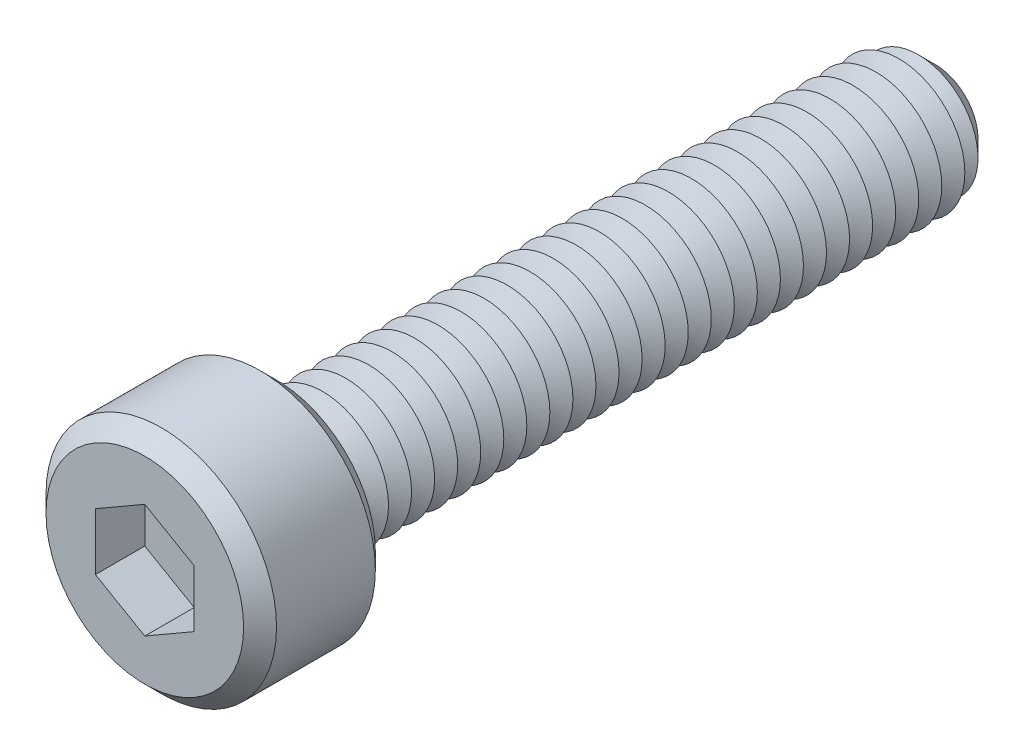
ISO-10303-21;
HEADER;
FILE_DESCRIPTION(('STEP AP214'),'2;1');
FILE_NAME('part.step','',(''),(''),'','','');
FILE_SCHEMA(('AUTOMOTIVE_DESIGN { 1 0 10303 214 1 1 1 1 }'));
ENDSEC;
DATA;
#1=APPLICATION_CONTEXT('core data for automotive mechanical design processes');
#2=APPLICATION_PROTOCOL_DEFINITION('international standard','automotive_design',2000,#1);
#3=PRODUCT_CONTEXT('',#1,'mechanical');
#4=PRODUCT('Part','Part','',(#3));
#5=PRODUCT_RELATED_PRODUCT_CATEGORY('part','',(#4));
#6=PRODUCT_DEFINITION_FORMATION('','',#4);
#7=PRODUCT_DEFINITION_CONTEXT('part definition',#1,'design');
#8=PRODUCT_DEFINITION('design','',#6,#7);
#9=PRODUCT_DEFINITION_SHAPE('','',#8);
#10=(LENGTH_UNIT() NAMED_UNIT(*) SI_UNIT(.MILLI.,.METRE.));
#11=(NAMED_UNIT(*) PLANE_ANGLE_UNIT() SI_UNIT($,.RADIAN.));
#12=(NAMED_UNIT(*) SI_UNIT($,.STERADIAN.) SOLID_ANGLE_UNIT());
#13=UNCERTAINTY_MEASURE_WITH_UNIT(LENGTH_MEASURE(1.E-05),#10,'distance_accuracy_value','');
#14=(GEOMETRIC_REPRESENTATION_CONTEXT(3) GLOBAL_UNCERTAINTY_ASSIGNED_CONTEXT((#13)) GLOBAL_UNIT_ASSIGNED_CONTEXT((#10,
#11,#12)) REPRESENTATION_CONTEXT('',''));
#15=CARTESIAN_POINT('',(0.,0.,0.));
#16=DIRECTION('',(0.,0.,1.));
#17=DIRECTION('',(1.,0.,0.));
#18=AXIS2_PLACEMENT_3D('',#15,#16,#17);
#19=CARTESIAN_POINT('',(0.,0.,4.));
#20=DIRECTION('',(0.,0.,-1.));
#21=DIRECTION('',(-1.,0.,0.));
#22=AXIS2_PLACEMENT_3D('',#19,#20,#21);
#23=CYLINDRICAL_SURFACE('',#22,3.5);
#24=CARTESIAN_POINT('',(0.,0.,0.5));
#25=DIRECTION('',(0.,0.,1.));
#26=DIRECTION('',(1.,0.,0.));
#27=AXIS2_PLACEMENT_3D('',#24,#25,#26);
#28=CIRCLE('',#27,3.5);
#29=CARTESIAN_POINT('',(3.5,0.,0.5));
#30=VERTEX_POINT('',#29);
#31=EDGE_CURVE('E400',#30,#30,#28,.T.);
#32=ORIENTED_EDGE('',*,*,#31,.T.);
#33=EDGE_LOOP('',(#32));
#34=FACE_BOUND('',#33,.T.);
#35=CARTESIAN_POINT('',(0.,0.,3.5));
#36=DIRECTION('',(0.,0.,1.));
#37=DIRECTION('',(1.,0.,0.));
#38=AXIS2_PLACEMENT_3D('',#35,#36,#37);
#39=CIRCLE('',#38,3.5);
#40=CARTESIAN_POINT('',(3.5,0.,3.5));
#41=VERTEX_POINT('',#40);
#42=EDGE_CURVE('E393',#41,#41,#39,.F.);
#43=ORIENTED_EDGE('',*,*,#42,.T.);
#44=EDGE_LOOP('',(#43));
#45=FACE_BOUND('',#44,.T.);
#46=ADVANCED_FACE('F39',(#34,#45),#23,.T.);
#47=CARTESIAN_POINT('',(0.,0.,4.));
#48=DIRECTION('',(0.,0.,1.));
#49=DIRECTION('',(1.,0.,0.));
#50=AXIS2_PLACEMENT_3D('',#47,#48,#49);
#51=PLANE('',#50);
#52=CARTESIAN_POINT('',(0.,0.,4.));
#53=DIRECTION('',(0.,0.,1.));
#54=DIRECTION('',(1.,0.,0.));
#55=AXIS2_PLACEMENT_3D('',#52,#53,#54);
#56=CIRCLE('',#55,3.);
#57=CARTESIAN_POINT('',(3.,0.,4.));
#58=VERTEX_POINT('',#57);
#59=EDGE_CURVE('E11',#58,#58,#56,.T.);
#60=ORIENTED_EDGE('',*,*,#59,.T.);
#61=EDGE_LOOP('',(#60));
#62=FACE_BOUND('',#61,.T.);
#63=DIRECTION('',(-0.866025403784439,0.5,0.));
#64=VECTOR('',#63,1.);
#65=CARTESIAN_POINT('',(1.5,0.866025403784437,4.));
#66=LINE('',#65,#64);
#67=CARTESIAN_POINT('',(1.5,0.866025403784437,4.));
#68=VERTEX_POINT('',#67);
#69=CARTESIAN_POINT('',(0.,1.73205080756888,4.));
#70=VERTEX_POINT('',#69);
#71=EDGE_CURVE('E55',#68,#70,#66,.T.);
#72=ORIENTED_EDGE('',*,*,#71,.F.);
#73=DIRECTION('',(0.,1.,0.));
#74=VECTOR('',#73,1.);
#75=CARTESIAN_POINT('',(1.5,-0.866025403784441,4.));
#76=LINE('',#75,#74);
#77=CARTESIAN_POINT('',(1.5,-0.866025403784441,4.));
#78=VERTEX_POINT('',#77);
#79=EDGE_CURVE('E151',#78,#68,#76,.T.);
#80=ORIENTED_EDGE('',*,*,#79,.F.);
#81=DIRECTION('',(0.866025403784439,0.5,0.));
#82=VECTOR('',#81,1.);
#83=CARTESIAN_POINT('',(0.,-1.73205080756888,4.));
#84=LINE('',#83,#82);
#85=CARTESIAN_POINT('',(0.,-1.73205080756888,4.));
#86=VERTEX_POINT('',#85);
#87=EDGE_CURVE('E148',#86,#78,#84,.T.);
#88=ORIENTED_EDGE('',*,*,#87,.F.);
#89=DIRECTION('',(0.866025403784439,-0.5,0.));
#90=VECTOR('',#89,1.);
#91=CARTESIAN_POINT('',(-1.5,-0.86602540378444,4.));
#92=LINE('',#91,#90);
#93=CARTESIAN_POINT('',(-1.5,-0.86602540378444,4.));
#94=VERTEX_POINT('',#93);
#95=EDGE_CURVE('E103',#94,#86,#92,.T.);
#96=ORIENTED_EDGE('',*,*,#95,.F.);
#97=DIRECTION('',(0.,-1.,0.));
#98=VECTOR('',#97,1.);
#99=CARTESIAN_POINT('',(-1.5,0.866025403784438,4.));
#100=LINE('',#99,#98);
#101=CARTESIAN_POINT('',(-1.5,0.866025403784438,4.));
#102=VERTEX_POINT('',#101);
#103=EDGE_CURVE('E142',#102,#94,#100,.T.);
#104=ORIENTED_EDGE('',*,*,#103,.F.);
#105=DIRECTION('',(-0.866025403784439,-0.5,0.));
#106=VECTOR('',#105,1.);
#107=CARTESIAN_POINT('',(0.,1.73205080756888,4.));
#108=LINE('',#107,#106);
#109=EDGE_CURVE('E137',#70,#102,#108,.T.);
#110=ORIENTED_EDGE('',*,*,#109,.F.);
#111=EDGE_LOOP('',(#72,#80,#88,#96,#104,#110));
#112=FACE_BOUND('',#111,.T.);
#113=ADVANCED_FACE('F418',(#62,#112),#51,.T.);
#114=CARTESIAN_POINT('',(0.,0.,0.));
#115=DIRECTION('',(0.,0.,1.));
#116=DIRECTION('',(1.,0.,0.));
#117=AXIS2_PLACEMENT_3D('',#114,#115,#116);
#118=PLANE('',#117);
#119=CARTESIAN_POINT('',(0.,0.,0.));
#120=DIRECTION('',(0.,0.,1.));
#121=DIRECTION('',(1.,0.,0.));
#122=AXIS2_PLACEMENT_3D('',#119,#120,#121);
#123=CIRCLE('',#122,3.);
#124=CARTESIAN_POINT('',(3.,0.,0.));
#125=VERTEX_POINT('',#124);
#126=EDGE_CURVE('E48',#125,#125,#123,.F.);
#127=ORIENTED_EDGE('',*,*,#126,.T.);
#128=EDGE_LOOP('',(#127));
#129=FACE_BOUND('',#128,.T.);
#130=CARTESIAN_POINT('',(0.,0.,0.));
#131=DIRECTION('',(0.,0.,1.));
#132=DIRECTION('',(1.,0.,0.));
#133=AXIS2_PLACEMENT_3D('',#130,#131,#132);
#134=CIRCLE('',#133,2.);
#135=CARTESIAN_POINT('',(2.,0.,0.));
#136=VERTEX_POINT('',#135);
#137=EDGE_CURVE('E385',#136,#136,#134,.T.);
#138=ORIENTED_EDGE('',*,*,#137,.T.);
#139=EDGE_LOOP('',(#138));
#140=FACE_BOUND('',#139,.T.);
#141=ADVANCED_FACE('F407',(#129,#140),#118,.F.);
#142=CARTESIAN_POINT('',(0.,0.,0.));
#143=DIRECTION('',(0.,0.,1.));
#144=DIRECTION('',(1.,0.,0.));
#145=AXIS2_PLACEMENT_3D('',#142,#143,#144);
#146=CONICAL_SURFACE('',#145,2.,1.0471975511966);
#147=CARTESIAN_POINT('',(0.,0.,-0.35));
#148=DIRECTION('',(0.,0.,1.));
#149=DIRECTION('',(1.,0.,0.));
#150=AXIS2_PLACEMENT_3D('',#147,#148,#149);
#151=CIRCLE('',#150,1.39378221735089);
#152=CARTESIAN_POINT('',(1.39378221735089,0.,-0.35));
#153=VERTEX_POINT('',#152);
#154=EDGE_CURVE('E381',#153,#153,#151,.T.);
#155=ORIENTED_EDGE('',*,*,#154,.T.);
#156=EDGE_LOOP('',(#155));
#157=FACE_BOUND('',#156,.T.);
#158=ORIENTED_EDGE('',*,*,#137,.F.);
#159=EDGE_LOOP('',(#158));
#160=FACE_BOUND('',#159,.T.);
#161=ADVANCED_FACE('F692',(#157,#160),#146,.T.);
#162=CARTESIAN_POINT('',(0.,0.,-0.35));
#163=DIRECTION('',(0.,0.,-1.));
#164=DIRECTION('',(-1.,0.,0.));
#165=AXIS2_PLACEMENT_3D('',#162,#163,#164);
#166=CONICAL_SURFACE('',#165,1.39378221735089,1.0471975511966);
#167=CARTESIAN_POINT('',(0.,0.,-0.7));
#168=DIRECTION('',(0.,0.,1.));
#169=DIRECTION('',(1.,0.,0.));
#170=AXIS2_PLACEMENT_3D('',#167,#168,#169);
#171=CIRCLE('',#170,2.);
#172=CARTESIAN_POINT('',(2.,0.,-0.7));
#173=VERTEX_POINT('',#172);
#174=EDGE_CURVE('E377',#173,#173,#171,.T.);
#175=ORIENTED_EDGE('',*,*,#174,.T.);
#176=EDGE_LOOP('',(#175));
#177=FACE_BOUND('',#176,.T.);
#178=ORIENTED_EDGE('',*,*,#154,.F.);
#179=EDGE_LOOP('',(#178));
#180=FACE_BOUND('',#179,.T.);
#181=ADVANCED_FACE('F688',(#177,#180),#166,.T.);
#182=CARTESIAN_POINT('',(0.,0.,-0.7));
#183=DIRECTION('',(0.,0.,1.));
#184=DIRECTION('',(1.,0.,0.));
#185=AXIS2_PLACEMENT_3D('',#182,#183,#184);
#186=CONICAL_SURFACE('',#185,2.,1.0471975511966);
#187=CARTESIAN_POINT('',(0.,0.,-1.05));
#188=DIRECTION('',(0.,0.,1.));
#189=DIRECTION('',(1.,0.,0.));
#190=AXIS2_PLACEMENT_3D('',#187,#188,#189);
#191=CIRCLE('',#190,1.39378221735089);
#192=CARTESIAN_POINT('',(1.39378221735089,0.,-1.05));
#193=VERTEX_POINT('',#192);
#194=EDGE_CURVE('E373',#193,#193,#191,.T.);
#195=ORIENTED_EDGE('',*,*,#194,.T.);
#196=EDGE_LOOP('',(#195));
#197=FACE_BOUND('',#196,.T.);
#198=ORIENTED_EDGE('',*,*,#174,.F.);
#199=EDGE_LOOP('',(#198));
#200=FACE_BOUND('',#199,.T.);
#201=ADVANCED_FACE('F684',(#197,#200),#186,.T.);
#202=CARTESIAN_POINT('',(0.,0.,-1.05));
#203=DIRECTION('',(0.,0.,-1.));
#204=DIRECTION('',(-1.,0.,0.));
#205=AXIS2_PLACEMENT_3D('',#202,#203,#204);
#206=CONICAL_SURFACE('',#205,1.39378221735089,1.0471975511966);
#207=CARTESIAN_POINT('',(0.,0.,-1.4));
#208=DIRECTION('',(0.,0.,1.));
#209=DIRECTION('',(1.,0.,0.));
#210=AXIS2_PLACEMENT_3D('',#207,#208,#209);
#211=CIRCLE('',#210,2.);
#212=CARTESIAN_POINT('',(2.,0.,-1.4));
#213=VERTEX_POINT('',#212);
#214=EDGE_CURVE('E370',#213,#213,#211,.T.);
#215=ORIENTED_EDGE('',*,*,#214,.T.);
#216=EDGE_LOOP('',(#215));
#217=FACE_BOUND('',#216,.T.);
#218=ORIENTED_EDGE('',*,*,#194,.F.);
#219=EDGE_LOOP('',(#218));
#220=FACE_BOUND('',#219,.T.);
#221=ADVANCED_FACE('F680',(#217,#220),#206,.T.);
#222=CARTESIAN_POINT('',(0.,0.,-1.4));
#223=DIRECTION('',(0.,0.,1.));
#224=DIRECTION('',(1.,0.,0.));
#225=AXIS2_PLACEMENT_3D('',#222,#223,#224);
#226=CONICAL_SURFACE('',#225,2.,1.0471975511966);
#227=CARTESIAN_POINT('',(0.,0.,-1.75));
#228=DIRECTION('',(0.,0.,1.));
#229=DIRECTION('',(1.,0.,0.));
#230=AXIS2_PLACEMENT_3D('',#227,#228,#229);
#231=CIRCLE('',#230,1.39378221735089);
#232=CARTESIAN_POINT('',(1.39378221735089,0.,-1.75));
#233=VERTEX_POINT('',#232);
#234=EDGE_CURVE('E366',#233,#233,#231,.T.);
#235=ORIENTED_EDGE('',*,*,#234,.T.);
#236=EDGE_LOOP('',(#235));
#237=FACE_BOUND('',#236,.T.);
#238=ORIENTED_EDGE('',*,*,#214,.F.);
#239=EDGE_LOOP('',(#238));
#240=FACE_BOUND('',#239,.T.);
#241=ADVANCED_FACE('F676',(#237,#240),#226,.T.);
#242=CARTESIAN_POINT('',(0.,0.,-1.75));
#243=DIRECTION('',(0.,0.,-1.));
#244=DIRECTION('',(-1.,0.,0.));
#245=AXIS2_PLACEMENT_3D('',#242,#243,#244);
#246=CONICAL_SURFACE('',#245,1.39378221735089,1.0471975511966);
#247=CARTESIAN_POINT('',(0.,0.,-2.1));
#248=DIRECTION('',(0.,0.,1.));
#249=DIRECTION('',(1.,0.,0.));
#250=AXIS2_PLACEMENT_3D('',#247,#248,#249);
#251=CIRCLE('',#250,2.);
#252=CARTESIAN_POINT('',(2.,0.,-2.1));
#253=VERTEX_POINT('',#252);
#254=EDGE_CURVE('E362',#253,#253,#251,.T.);
#255=ORIENTED_EDGE('',*,*,#254,.T.);
#256=EDGE_LOOP('',(#255));
#257=FACE_BOUND('',#256,.T.);
#258=ORIENTED_EDGE('',*,*,#234,.F.);
#259=EDGE_LOOP('',(#258));
#260=FACE_BOUND('',#259,.T.);
#261=ADVANCED_FACE('F672',(#257,#260),#246,.T.);
#262=CARTESIAN_POINT('',(0.,0.,-2.1));
#263=DIRECTION('',(0.,0.,1.));
#264=DIRECTION('',(1.,0.,0.));
#265=AXIS2_PLACEMENT_3D('',#262,#263,#264);
#266=CONICAL_SURFACE('',#265,2.,1.0471975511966);
#267=CARTESIAN_POINT('',(0.,0.,-2.45));
#268=DIRECTION('',(0.,0.,1.));
#269=DIRECTION('',(1.,0.,0.));
#270=AXIS2_PLACEMENT_3D('',#267,#268,#269);
#271=CIRCLE('',#270,1.39378221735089);
#272=CARTESIAN_POINT('',(1.39378221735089,0.,-2.45));
#273=VERTEX_POINT('',#272);
#274=EDGE_CURVE('E358',#273,#273,#271,.T.);
#275=ORIENTED_EDGE('',*,*,#274,.T.);
#276=EDGE_LOOP('',(#275));
#277=FACE_BOUND('',#276,.T.);
#278=ORIENTED_EDGE('',*,*,#254,.F.);
#279=EDGE_LOOP('',(#278));
#280=FACE_BOUND('',#279,.T.);
#281=ADVANCED_FACE('F668',(#277,#280),#266,.T.);
#282=CARTESIAN_POINT('',(0.,0.,-2.45));
#283=DIRECTION('',(0.,0.,-1.));
#284=DIRECTION('',(-1.,0.,0.));
#285=AXIS2_PLACEMENT_3D('',#282,#283,#284);
#286=CONICAL_SURFACE('',#285,1.39378221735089,1.0471975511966);
#287=CARTESIAN_POINT('',(0.,0.,-2.8));
#288=DIRECTION('',(0.,0.,1.));
#289=DIRECTION('',(1.,0.,0.));
#290=AXIS2_PLACEMENT_3D('',#287,#288,#289);
#291=CIRCLE('',#290,2.);
#292=CARTESIAN_POINT('',(2.,0.,-2.8));
#293=VERTEX_POINT('',#292);
#294=EDGE_CURVE('E354',#293,#293,#291,.T.);
#295=ORIENTED_EDGE('',*,*,#294,.T.);
#296=EDGE_LOOP('',(#295));
#297=FACE_BOUND('',#296,.T.);
#298=ORIENTED_EDGE('',*,*,#274,.F.);
#299=EDGE_LOOP('',(#298));
#300=FACE_BOUND('',#299,.T.);
#301=ADVANCED_FACE('F664',(#297,#300),#286,.T.);
#302=CARTESIAN_POINT('',(0.,0.,-2.8));
#303=DIRECTION('',(0.,0.,1.));
#304=DIRECTION('',(1.,0.,0.));
#305=AXIS2_PLACEMENT_3D('',#302,#303,#304);
#306=CONICAL_SURFACE('',#305,2.,1.0471975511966);
#307=CARTESIAN_POINT('',(0.,0.,-3.15));
#308=DIRECTION('',(0.,0.,1.));
#309=DIRECTION('',(1.,0.,0.));
#310=AXIS2_PLACEMENT_3D('',#307,#308,#309);
#311=CIRCLE('',#310,1.39378221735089);
#312=CARTESIAN_POINT('',(1.39378221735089,0.,-3.15));
#313=VERTEX_POINT('',#312);
#314=EDGE_CURVE('E350',#313,#313,#311,.T.);
#315=ORIENTED_EDGE('',*,*,#314,.T.);
#316=EDGE_LOOP('',(#315));
#317=FACE_BOUND('',#316,.T.);
#318=ORIENTED_EDGE('',*,*,#294,.F.);
#319=EDGE_LOOP('',(#318));
#320=FACE_BOUND('',#319,.T.);
#321=ADVANCED_FACE('F660',(#317,#320),#306,.T.);
#322=CARTESIAN_POINT('',(0.,0.,-3.15));
#323=DIRECTION('',(0.,0.,-1.));
#324=DIRECTION('',(-1.,0.,0.));
#325=AXIS2_PLACEMENT_3D('',#322,#323,#324);
#326=CONICAL_SURFACE('',#325,1.39378221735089,1.0471975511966);
#327=CARTESIAN_POINT('',(0.,0.,-3.5));
#328=DIRECTION('',(0.,0.,1.));
#329=DIRECTION('',(1.,0.,0.));
#330=AXIS2_PLACEMENT_3D('',#327,#328,#329);
#331=CIRCLE('',#330,2.);
#332=CARTESIAN_POINT('',(2.,0.,-3.5));
#333=VERTEX_POINT('',#332);
#334=EDGE_CURVE('E346',#333,#333,#331,.T.);
#335=ORIENTED_EDGE('',*,*,#334,.T.);
#336=EDGE_LOOP('',(#335));
#337=FACE_BOUND('',#336,.T.);
#338=ORIENTED_EDGE('',*,*,#314,.F.);
#339=EDGE_LOOP('',(#338));
#340=FACE_BOUND('',#339,.T.);
#341=ADVANCED_FACE('F656',(#337,#340),#326,.T.);
#342=CARTESIAN_POINT('',(0.,0.,-3.5));
#343=DIRECTION('',(0.,0.,1.));
#344=DIRECTION('',(1.,0.,0.));
#345=AXIS2_PLACEMENT_3D('',#342,#343,#344);
#346=CONICAL_SURFACE('',#345,2.,1.0471975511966);
#347=CARTESIAN_POINT('',(0.,0.,-3.85));
#348=DIRECTION('',(0.,0.,1.));
#349=DIRECTION('',(1.,0.,0.));
#350=AXIS2_PLACEMENT_3D('',#347,#348,#349);
#351=CIRCLE('',#350,1.39378221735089);
#352=CARTESIAN_POINT('',(1.39378221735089,0.,-3.85));
#353=VERTEX_POINT('',#352);
#354=EDGE_CURVE('E342',#353,#353,#351,.T.);
#355=ORIENTED_EDGE('',*,*,#354,.T.);
#356=EDGE_LOOP('',(#355));
#357=FACE_BOUND('',#356,.T.);
#358=ORIENTED_EDGE('',*,*,#334,.F.);
#359=EDGE_LOOP('',(#358));
#360=FACE_BOUND('',#359,.T.);
#361=ADVANCED_FACE('F652',(#357,#360),#346,.T.);
#362=CARTESIAN_POINT('',(0.,0.,-3.85));
#363=DIRECTION('',(0.,0.,-1.));
#364=DIRECTION('',(-1.,0.,0.));
#365=AXIS2_PLACEMENT_3D('',#362,#363,#364);
#366=CONICAL_SURFACE('',#365,1.39378221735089,1.0471975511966);
#367=CARTESIAN_POINT('',(0.,0.,-4.2));
#368=DIRECTION('',(0.,0.,1.));
#369=DIRECTION('',(1.,0.,0.));
#370=AXIS2_PLACEMENT_3D('',#367,#368,#369);
#371=CIRCLE('',#370,2.);
#372=CARTESIAN_POINT('',(2.,0.,-4.2));
#373=VERTEX_POINT('',#372);
#374=EDGE_CURVE('E338',#373,#373,#371,.T.);
#375=ORIENTED_EDGE('',*,*,#374,.T.);
#376=EDGE_LOOP('',(#375));
#377=FACE_BOUND('',#376,.T.);
#378=ORIENTED_EDGE('',*,*,#354,.F.);
#379=EDGE_LOOP('',(#378));
#380=FACE_BOUND('',#379,.T.);
#381=ADVANCED_FACE('F648',(#377,#380),#366,.T.);
#382=CARTESIAN_POINT('',(0.,0.,-4.2));
#383=DIRECTION('',(0.,0.,1.));
#384=DIRECTION('',(1.,0.,0.));
#385=AXIS2_PLACEMENT_3D('',#382,#383,#384);
#386=CONICAL_SURFACE('',#385,2.,1.0471975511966);
#387=CARTESIAN_POINT('',(0.,0.,-4.55));
#388=DIRECTION('',(0.,0.,1.));
#389=DIRECTION('',(1.,0.,0.));
#390=AXIS2_PLACEMENT_3D('',#387,#388,#389);
#391=CIRCLE('',#390,1.39378221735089);
#392=CARTESIAN_POINT('',(1.39378221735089,0.,-4.55));
#393=VERTEX_POINT('',#392);
#394=EDGE_CURVE('E334',#393,#393,#391,.T.);
#395=ORIENTED_EDGE('',*,*,#394,.T.);
#396=EDGE_LOOP('',(#395));
#397=FACE_BOUND('',#396,.T.);
#398=ORIENTED_EDGE('',*,*,#374,.F.);
#399=EDGE_LOOP('',(#398));
#400=FACE_BOUND('',#399,.T.);
#401=ADVANCED_FACE('F644',(#397,#400),#386,.T.);
#402=CARTESIAN_POINT('',(0.,0.,-4.55));
#403=DIRECTION('',(0.,0.,-1.));
#404=DIRECTION('',(-1.,0.,0.));
#405=AXIS2_PLACEMENT_3D('',#402,#403,#404);
#406=CONICAL_SURFACE('',#405,1.39378221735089,1.0471975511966);
#407=CARTESIAN_POINT('',(0.,0.,-4.9));
#408=DIRECTION('',(0.,0.,1.));
#409=DIRECTION('',(1.,0.,0.));
#410=AXIS2_PLACEMENT_3D('',#407,#408,#409);
#411=CIRCLE('',#410,2.);
#412=CARTESIAN_POINT('',(2.,0.,-4.9));
#413=VERTEX_POINT('',#412);
#414=EDGE_CURVE('E330',#413,#413,#411,.T.);
#415=ORIENTED_EDGE('',*,*,#414,.T.);
#416=EDGE_LOOP('',(#415));
#417=FACE_BOUND('',#416,.T.);
#418=ORIENTED_EDGE('',*,*,#394,.F.);
#419=EDGE_LOOP('',(#418));
#420=FACE_BOUND('',#419,.T.);
#421=ADVANCED_FACE('F640',(#417,#420),#406,.T.);
#422=CARTESIAN_POINT('',(0.,0.,-4.9));
#423=DIRECTION('',(0.,0.,1.));
#424=DIRECTION('',(1.,0.,0.));
#425=AXIS2_PLACEMENT_3D('',#422,#423,#424);
#426=CONICAL_SURFACE('',#425,2.,1.0471975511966);
#427=CARTESIAN_POINT('',(0.,0.,-5.25));
#428=DIRECTION('',(0.,0.,1.));
#429=DIRECTION('',(1.,0.,0.));
#430=AXIS2_PLACEMENT_3D('',#427,#428,#429);
#431=CIRCLE('',#430,1.39378221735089);
#432=CARTESIAN_POINT('',(1.39378221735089,0.,-5.25));
#433=VERTEX_POINT('',#432);
#434=EDGE_CURVE('E326',#433,#433,#431,.T.);
#435=ORIENTED_EDGE('',*,*,#434,.T.);
#436=EDGE_LOOP('',(#435));
#437=FACE_BOUND('',#436,.T.);
#438=ORIENTED_EDGE('',*,*,#414,.F.);
#439=EDGE_LOOP('',(#438));
#440=FACE_BOUND('',#439,.T.);
#441=ADVANCED_FACE('F636',(#437,#440),#426,.T.);
#442=CARTESIAN_POINT('',(0.,0.,-5.25));
#443=DIRECTION('',(0.,0.,-1.));
#444=DIRECTION('',(-1.,0.,0.));
#445=AXIS2_PLACEMENT_3D('',#442,#443,#444);
#446=CONICAL_SURFACE('',#445,1.39378221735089,1.0471975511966);
#447=CARTESIAN_POINT('',(0.,0.,-5.6));
#448=DIRECTION('',(0.,0.,1.));
#449=DIRECTION('',(1.,0.,0.));
#450=AXIS2_PLACEMENT_3D('',#447,#448,#449);
#451=CIRCLE('',#450,2.);
#452=CARTESIAN_POINT('',(2.,0.,-5.6));
#453=VERTEX_POINT('',#452);
#454=EDGE_CURVE('E322',#453,#453,#451,.T.);
#455=ORIENTED_EDGE('',*,*,#454,.T.);
#456=EDGE_LOOP('',(#455));
#457=FACE_BOUND('',#456,.T.);
#458=ORIENTED_EDGE('',*,*,#434,.F.);
#459=EDGE_LOOP('',(#458));
#460=FACE_BOUND('',#459,.T.);
#461=ADVANCED_FACE('F632',(#457,#460),#446,.T.);
#462=CARTESIAN_POINT('',(0.,0.,-5.6));
#463=DIRECTION('',(0.,0.,1.));
#464=DIRECTION('',(1.,0.,0.));
#465=AXIS2_PLACEMENT_3D('',#462,#463,#464);
#466=CONICAL_SURFACE('',#465,2.,1.0471975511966);
#467=CARTESIAN_POINT('',(0.,0.,-5.95));
#468=DIRECTION('',(0.,0.,1.));
#469=DIRECTION('',(1.,0.,0.));
#470=AXIS2_PLACEMENT_3D('',#467,#468,#469);
#471=CIRCLE('',#470,1.39378221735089);
#472=CARTESIAN_POINT('',(1.39378221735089,0.,-5.95));
#473=VERTEX_POINT('',#472);
#474=EDGE_CURVE('E318',#473,#473,#471,.T.);
#475=ORIENTED_EDGE('',*,*,#474,.T.);
#476=EDGE_LOOP('',(#475));
#477=FACE_BOUND('',#476,.T.);
#478=ORIENTED_EDGE('',*,*,#454,.F.);
#479=EDGE_LOOP('',(#478));
#480=FACE_BOUND('',#479,.T.);
#481=ADVANCED_FACE('F628',(#477,#480),#466,.T.);
#482=CARTESIAN_POINT('',(0.,0.,-5.95));
#483=DIRECTION('',(0.,0.,-1.));
#484=DIRECTION('',(-1.,0.,0.));
#485=AXIS2_PLACEMENT_3D('',#482,#483,#484);
#486=CONICAL_SURFACE('',#485,1.39378221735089,1.0471975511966);
#487=CARTESIAN_POINT('',(0.,0.,-6.3));
#488=DIRECTION('',(0.,0.,1.));
#489=DIRECTION('',(1.,0.,0.));
#490=AXIS2_PLACEMENT_3D('',#487,#488,#489);
#491=CIRCLE('',#490,2.);
#492=CARTESIAN_POINT('',(2.,0.,-6.3));
#493=VERTEX_POINT('',#492);
#494=EDGE_CURVE('E314',#493,#493,#491,.T.);
#495=ORIENTED_EDGE('',*,*,#494,.T.);
#496=EDGE_LOOP('',(#495));
#497=FACE_BOUND('',#496,.T.);
#498=ORIENTED_EDGE('',*,*,#474,.F.);
#499=EDGE_LOOP('',(#498));
#500=FACE_BOUND('',#499,.T.);
#501=ADVANCED_FACE('F624',(#497,#500),#486,.T.);
#502=CARTESIAN_POINT('',(0.,0.,-6.3));
#503=DIRECTION('',(0.,0.,1.));
#504=DIRECTION('',(1.,0.,0.));
#505=AXIS2_PLACEMENT_3D('',#502,#503,#504);
#506=CONICAL_SURFACE('',#505,2.,1.0471975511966);
#507=CARTESIAN_POINT('',(0.,0.,-6.65));
#508=DIRECTION('',(0.,0.,1.));
#509=DIRECTION('',(1.,0.,0.));
#510=AXIS2_PLACEMENT_3D('',#507,#508,#509);
#511=CIRCLE('',#510,1.39378221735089);
#512=CARTESIAN_POINT('',(1.39378221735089,0.,-6.65));
#513=VERTEX_POINT('',#512);
#514=EDGE_CURVE('E310',#513,#513,#511,.T.);
#515=ORIENTED_EDGE('',*,*,#514,.T.);
#516=EDGE_LOOP('',(#515));
#517=FACE_BOUND('',#516,.T.);
#518=ORIENTED_EDGE('',*,*,#494,.F.);
#519=EDGE_LOOP('',(#518));
#520=FACE_BOUND('',#519,.T.);
#521=ADVANCED_FACE('F620',(#517,#520),#506,.T.);
#522=CARTESIAN_POINT('',(0.,0.,-6.65));
#523=DIRECTION('',(0.,0.,-1.));
#524=DIRECTION('',(-1.,0.,0.));
#525=AXIS2_PLACEMENT_3D('',#522,#523,#524);
#526=CONICAL_SURFACE('',#525,1.39378221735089,1.0471975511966);
#527=CARTESIAN_POINT('',(0.,0.,-7.));
#528=DIRECTION('',(0.,0.,1.));
#529=DIRECTION('',(1.,0.,0.));
#530=AXIS2_PLACEMENT_3D('',#527,#528,#529);
#531=CIRCLE('',#530,2.);
#532=CARTESIAN_POINT('',(2.,0.,-7.));
#533=VERTEX_POINT('',#532);
#534=EDGE_CURVE('E306',#533,#533,#531,.T.);
#535=ORIENTED_EDGE('',*,*,#534,.T.);
#536=EDGE_LOOP('',(#535));
#537=FACE_BOUND('',#536,.T.);
#538=ORIENTED_EDGE('',*,*,#514,.F.);
#539=EDGE_LOOP('',(#538));
#540=FACE_BOUND('',#539,.T.);
#541=ADVANCED_FACE('F616',(#537,#540),#526,.T.);
#542=CARTESIAN_POINT('',(0.,0.,-7.));
#543=DIRECTION('',(0.,0.,1.));
#544=DIRECTION('',(1.,0.,0.));
#545=AXIS2_PLACEMENT_3D('',#542,#543,#544);
#546=CONICAL_SURFACE('',#545,2.,1.0471975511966);
#547=CARTESIAN_POINT('',(0.,0.,-7.35));
#548=DIRECTION('',(0.,0.,1.));
#549=DIRECTION('',(1.,0.,0.));
#550=AXIS2_PLACEMENT_3D('',#547,#548,#549);
#551=CIRCLE('',#550,1.39378221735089);
#552=CARTESIAN_POINT('',(1.39378221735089,0.,-7.35));
#553=VERTEX_POINT('',#552);
#554=EDGE_CURVE('E302',#553,#553,#551,.T.);
#555=ORIENTED_EDGE('',*,*,#554,.T.);
#556=EDGE_LOOP('',(#555));
#557=FACE_BOUND('',#556,.T.);
#558=ORIENTED_EDGE('',*,*,#534,.F.);
#559=EDGE_LOOP('',(#558));
#560=FACE_BOUND('',#559,.T.);
#561=ADVANCED_FACE('F612',(#557,#560),#546,.T.);
#562=CARTESIAN_POINT('',(0.,0.,-7.35));
#563=DIRECTION('',(0.,0.,-1.));
#564=DIRECTION('',(-1.,0.,0.));
#565=AXIS2_PLACEMENT_3D('',#562,#563,#564);
#566=CONICAL_SURFACE('',#565,1.39378221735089,1.0471975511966);
#567=CARTESIAN_POINT('',(0.,0.,-7.7));
#568=DIRECTION('',(0.,0.,1.));
#569=DIRECTION('',(1.,0.,0.));
#570=AXIS2_PLACEMENT_3D('',#567,#568,#569);
#571=CIRCLE('',#570,2.);
#572=CARTESIAN_POINT('',(2.,0.,-7.7));
#573=VERTEX_POINT('',#572);
#574=EDGE_CURVE('E298',#573,#573,#571,.T.);
#575=ORIENTED_EDGE('',*,*,#574,.T.);
#576=EDGE_LOOP('',(#575));
#577=FACE_BOUND('',#576,.T.);
#578=ORIENTED_EDGE('',*,*,#554,.F.);
#579=EDGE_LOOP('',(#578));
#580=FACE_BOUND('',#579,.T.);
#581=ADVANCED_FACE('F608',(#577,#580),#566,.T.);
#582=CARTESIAN_POINT('',(0.,0.,-7.7));
#583=DIRECTION('',(0.,0.,1.));
#584=DIRECTION('',(1.,0.,0.));
#585=AXIS2_PLACEMENT_3D('',#582,#583,#584);
#586=CONICAL_SURFACE('',#585,2.,1.0471975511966);
#587=CARTESIAN_POINT('',(0.,0.,-8.05));
#588=DIRECTION('',(0.,0.,1.));
#589=DIRECTION('',(1.,0.,0.));
#590=AXIS2_PLACEMENT_3D('',#587,#588,#589);
#591=CIRCLE('',#590,1.39378221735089);
#592=CARTESIAN_POINT('',(1.39378221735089,0.,-8.05));
#593=VERTEX_POINT('',#592);
#594=EDGE_CURVE('E294',#593,#593,#591,.T.);
#595=ORIENTED_EDGE('',*,*,#594,.T.);
#596=EDGE_LOOP('',(#595));
#597=FACE_BOUND('',#596,.T.);
#598=ORIENTED_EDGE('',*,*,#574,.F.);
#599=EDGE_LOOP('',(#598));
#600=FACE_BOUND('',#599,.T.);
#601=ADVANCED_FACE('F604',(#597,#600),#586,.T.);
#602=CARTESIAN_POINT('',(0.,0.,-8.05));
#603=DIRECTION('',(0.,0.,-1.));
#604=DIRECTION('',(-1.,0.,0.));
#605=AXIS2_PLACEMENT_3D('',#602,#603,#604);
#606=CONICAL_SURFACE('',#605,1.39378221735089,1.0471975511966);
#607=CARTESIAN_POINT('',(0.,0.,-8.4));
#608=DIRECTION('',(0.,0.,1.));
#609=DIRECTION('',(1.,0.,0.));
#610=AXIS2_PLACEMENT_3D('',#607,#608,#609);
#611=CIRCLE('',#610,2.);
#612=CARTESIAN_POINT('',(2.,0.,-8.4));
#613=VERTEX_POINT('',#612);
#614=EDGE_CURVE('E290',#613,#613,#611,.T.);
#615=ORIENTED_EDGE('',*,*,#614,.T.);
#616=EDGE_LOOP('',(#615));
#617=FACE_BOUND('',#616,.T.);
#618=ORIENTED_EDGE('',*,*,#594,.F.);
#619=EDGE_LOOP('',(#618));
#620=FACE_BOUND('',#619,.T.);
#621=ADVANCED_FACE('F600',(#617,#620),#606,.T.);
#622=CARTESIAN_POINT('',(0.,0.,-8.4));
#623=DIRECTION('',(0.,0.,1.));
#624=DIRECTION('',(1.,0.,0.));
#625=AXIS2_PLACEMENT_3D('',#622,#623,#624);
#626=CONICAL_SURFACE('',#625,2.,1.0471975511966);
#627=CARTESIAN_POINT('',(0.,0.,-8.75));
#628=DIRECTION('',(0.,0.,1.));
#629=DIRECTION('',(1.,0.,0.));
#630=AXIS2_PLACEMENT_3D('',#627,#628,#629);
#631=CIRCLE('',#630,1.39378221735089);
#632=CARTESIAN_POINT('',(1.39378221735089,0.,-8.75));
#633=VERTEX_POINT('',#632);
#634=EDGE_CURVE('E286',#633,#633,#631,.T.);
#635=ORIENTED_EDGE('',*,*,#634,.T.);
#636=EDGE_LOOP('',(#635));
#637=FACE_BOUND('',#636,.T.);
#638=ORIENTED_EDGE('',*,*,#614,.F.);
#639=EDGE_LOOP('',(#638));
#640=FACE_BOUND('',#639,.T.);
#641=ADVANCED_FACE('F596',(#637,#640),#626,.T.);
#642=CARTESIAN_POINT('',(0.,0.,-8.75));
#643=DIRECTION('',(0.,0.,-1.));
#644=DIRECTION('',(-1.,0.,0.));
#645=AXIS2_PLACEMENT_3D('',#642,#643,#644);
#646=CONICAL_SURFACE('',#645,1.39378221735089,1.0471975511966);
#647=CARTESIAN_POINT('',(0.,0.,-9.1));
#648=DIRECTION('',(0.,0.,1.));
#649=DIRECTION('',(1.,0.,0.));
#650=AXIS2_PLACEMENT_3D('',#647,#648,#649);
#651=CIRCLE('',#650,2.);
#652=CARTESIAN_POINT('',(2.,0.,-9.1));
#653=VERTEX_POINT('',#652);
#654=EDGE_CURVE('E282',#653,#653,#651,.T.);
#655=ORIENTED_EDGE('',*,*,#654,.T.);
#656=EDGE_LOOP('',(#655));
#657=FACE_BOUND('',#656,.T.);
#658=ORIENTED_EDGE('',*,*,#634,.F.);
#659=EDGE_LOOP('',(#658));
#660=FACE_BOUND('',#659,.T.);
#661=ADVANCED_FACE('F592',(#657,#660),#646,.T.);
#662=CARTESIAN_POINT('',(0.,0.,-9.1));
#663=DIRECTION('',(0.,0.,1.));
#664=DIRECTION('',(1.,0.,0.));
#665=AXIS2_PLACEMENT_3D('',#662,#663,#664);
#666=CONICAL_SURFACE('',#665,2.,1.0471975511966);
#667=CARTESIAN_POINT('',(0.,0.,-9.45));
#668=DIRECTION('',(0.,0.,1.));
#669=DIRECTION('',(1.,0.,0.));
#670=AXIS2_PLACEMENT_3D('',#667,#668,#669);
#671=CIRCLE('',#670,1.39378221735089);
#672=CARTESIAN_POINT('',(1.39378221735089,0.,-9.45));
#673=VERTEX_POINT('',#672);
#674=EDGE_CURVE('E278',#673,#673,#671,.T.);
#675=ORIENTED_EDGE('',*,*,#674,.T.);
#676=EDGE_LOOP('',(#675));
#677=FACE_BOUND('',#676,.T.);
#678=ORIENTED_EDGE('',*,*,#654,.F.);
#679=EDGE_LOOP('',(#678));
#680=FACE_BOUND('',#679,.T.);
#681=ADVANCED_FACE('F588',(#677,#680),#666,.T.);
#682=CARTESIAN_POINT('',(0.,0.,-9.45));
#683=DIRECTION('',(0.,0.,-1.));
#684=DIRECTION('',(-1.,0.,0.));
#685=AXIS2_PLACEMENT_3D('',#682,#683,#684);
#686=CONICAL_SURFACE('',#685,1.39378221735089,1.0471975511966);
#687=CARTESIAN_POINT('',(0.,0.,-9.8));
#688=DIRECTION('',(0.,0.,1.));
#689=DIRECTION('',(1.,0.,0.));
#690=AXIS2_PLACEMENT_3D('',#687,#688,#689);
#691=CIRCLE('',#690,2.);
#692=CARTESIAN_POINT('',(2.,0.,-9.8));
#693=VERTEX_POINT('',#692);
#694=EDGE_CURVE('E274',#693,#693,#691,.T.);
#695=ORIENTED_EDGE('',*,*,#694,.T.);
#696=EDGE_LOOP('',(#695));
#697=FACE_BOUND('',#696,.T.);
#698=ORIENTED_EDGE('',*,*,#674,.F.);
#699=EDGE_LOOP('',(#698));
#700=FACE_BOUND('',#699,.T.);
#701=ADVANCED_FACE('F584',(#697,#700),#686,.T.);
#702=CARTESIAN_POINT('',(0.,0.,-9.8));
#703=DIRECTION('',(0.,0.,1.));
#704=DIRECTION('',(1.,0.,0.));
#705=AXIS2_PLACEMENT_3D('',#702,#703,#704);
#706=CONICAL_SURFACE('',#705,2.,1.0471975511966);
#707=CARTESIAN_POINT('',(0.,0.,-10.15));
#708=DIRECTION('',(0.,0.,1.));
#709=DIRECTION('',(1.,0.,0.));
#710=AXIS2_PLACEMENT_3D('',#707,#708,#709);
#711=CIRCLE('',#710,1.39378221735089);
#712=CARTESIAN_POINT('',(1.39378221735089,0.,-10.15));
#713=VERTEX_POINT('',#712);
#714=EDGE_CURVE('E270',#713,#713,#711,.T.);
#715=ORIENTED_EDGE('',*,*,#714,.T.);
#716=EDGE_LOOP('',(#715));
#717=FACE_BOUND('',#716,.T.);
#718=ORIENTED_EDGE('',*,*,#694,.F.);
#719=EDGE_LOOP('',(#718));
#720=FACE_BOUND('',#719,.T.);
#721=ADVANCED_FACE('F580',(#717,#720),#706,.T.);
#722=CARTESIAN_POINT('',(0.,0.,-10.15));
#723=DIRECTION('',(0.,0.,-1.));
#724=DIRECTION('',(-1.,0.,0.));
#725=AXIS2_PLACEMENT_3D('',#722,#723,#724);
#726=CONICAL_SURFACE('',#725,1.39378221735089,1.0471975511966);
#727=CARTESIAN_POINT('',(0.,0.,-10.5));
#728=DIRECTION('',(0.,0.,1.));
#729=DIRECTION('',(1.,0.,0.));
#730=AXIS2_PLACEMENT_3D('',#727,#728,#729);
#731=CIRCLE('',#730,2.);
#732=CARTESIAN_POINT('',(2.,0.,-10.5));
#733=VERTEX_POINT('',#732);
#734=EDGE_CURVE('E266',#733,#733,#731,.T.);
#735=ORIENTED_EDGE('',*,*,#734,.T.);
#736=EDGE_LOOP('',(#735));
#737=FACE_BOUND('',#736,.T.);
#738=ORIENTED_EDGE('',*,*,#714,.F.);
#739=EDGE_LOOP('',(#738));
#740=FACE_BOUND('',#739,.T.);
#741=ADVANCED_FACE('F576',(#737,#740),#726,.T.);
#742=CARTESIAN_POINT('',(0.,0.,-10.5));
#743=DIRECTION('',(0.,0.,1.));
#744=DIRECTION('',(1.,0.,0.));
#745=AXIS2_PLACEMENT_3D('',#742,#743,#744);
#746=CONICAL_SURFACE('',#745,2.,1.0471975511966);
#747=CARTESIAN_POINT('',(0.,0.,-10.85));
#748=DIRECTION('',(0.,0.,1.));
#749=DIRECTION('',(1.,0.,0.));
#750=AXIS2_PLACEMENT_3D('',#747,#748,#749);
#751=CIRCLE('',#750,1.39378221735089);
#752=CARTESIAN_POINT('',(1.39378221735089,0.,-10.85));
#753=VERTEX_POINT('',#752);
#754=EDGE_CURVE('E262',#753,#753,#751,.T.);
#755=ORIENTED_EDGE('',*,*,#754,.T.);
#756=EDGE_LOOP('',(#755));
#757=FACE_BOUND('',#756,.T.);
#758=ORIENTED_EDGE('',*,*,#734,.F.);
#759=EDGE_LOOP('',(#758));
#760=FACE_BOUND('',#759,.T.);
#761=ADVANCED_FACE('F572',(#757,#760),#746,.T.);
#762=CARTESIAN_POINT('',(0.,0.,-10.85));
#763=DIRECTION('',(0.,0.,-1.));
#764=DIRECTION('',(-1.,0.,0.));
#765=AXIS2_PLACEMENT_3D('',#762,#763,#764);
#766=CONICAL_SURFACE('',#765,1.39378221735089,1.0471975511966);
#767=CARTESIAN_POINT('',(0.,0.,-11.2));
#768=DIRECTION('',(0.,0.,1.));
#769=DIRECTION('',(1.,0.,0.));
#770=AXIS2_PLACEMENT_3D('',#767,#768,#769);
#771=CIRCLE('',#770,2.);
#772=CARTESIAN_POINT('',(2.,0.,-11.2));
#773=VERTEX_POINT('',#772);
#774=EDGE_CURVE('E258',#773,#773,#771,.T.);
#775=ORIENTED_EDGE('',*,*,#774,.T.);
#776=EDGE_LOOP('',(#775));
#777=FACE_BOUND('',#776,.T.);
#778=ORIENTED_EDGE('',*,*,#754,.F.);
#779=EDGE_LOOP('',(#778));
#780=FACE_BOUND('',#779,.T.);
#781=ADVANCED_FACE('F568',(#777,#780),#766,.T.);
#782=CARTESIAN_POINT('',(0.,0.,-11.2));
#783=DIRECTION('',(0.,0.,1.));
#784=DIRECTION('',(1.,0.,0.));
#785=AXIS2_PLACEMENT_3D('',#782,#783,#784);
#786=CONICAL_SURFACE('',#785,2.,1.0471975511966);
#787=CARTESIAN_POINT('',(0.,0.,-11.55));
#788=DIRECTION('',(0.,0.,1.));
#789=DIRECTION('',(1.,0.,0.));
#790=AXIS2_PLACEMENT_3D('',#787,#788,#789);
#791=CIRCLE('',#790,1.39378221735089);
#792=CARTESIAN_POINT('',(1.39378221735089,0.,-11.55));
#793=VERTEX_POINT('',#792);
#794=EDGE_CURVE('E254',#793,#793,#791,.T.);
#795=ORIENTED_EDGE('',*,*,#794,.T.);
#796=EDGE_LOOP('',(#795));
#797=FACE_BOUND('',#796,.T.);
#798=ORIENTED_EDGE('',*,*,#774,.F.);
#799=EDGE_LOOP('',(#798));
#800=FACE_BOUND('',#799,.T.);
#801=ADVANCED_FACE('F564',(#797,#800),#786,.T.);
#802=CARTESIAN_POINT('',(0.,0.,-11.55));
#803=DIRECTION('',(0.,0.,-1.));
#804=DIRECTION('',(-1.,0.,0.));
#805=AXIS2_PLACEMENT_3D('',#802,#803,#804);
#806=CONICAL_SURFACE('',#805,1.39378221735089,1.0471975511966);
#807=CARTESIAN_POINT('',(0.,0.,-11.9));
#808=DIRECTION('',(0.,0.,1.));
#809=DIRECTION('',(1.,0.,0.));
#810=AXIS2_PLACEMENT_3D('',#807,#808,#809);
#811=CIRCLE('',#810,2.);
#812=CARTESIAN_POINT('',(2.,0.,-11.9));
#813=VERTEX_POINT('',#812);
#814=EDGE_CURVE('E250',#813,#813,#811,.T.);
#815=ORIENTED_EDGE('',*,*,#814,.T.);
#816=EDGE_LOOP('',(#815));
#817=FACE_BOUND('',#816,.T.);
#818=ORIENTED_EDGE('',*,*,#794,.F.);
#819=EDGE_LOOP('',(#818));
#820=FACE_BOUND('',#819,.T.);
#821=ADVANCED_FACE('F560',(#817,#820),#806,.T.);
#822=CARTESIAN_POINT('',(0.,0.,-11.9));
#823=DIRECTION('',(0.,0.,1.));
#824=DIRECTION('',(1.,0.,0.));
#825=AXIS2_PLACEMENT_3D('',#822,#823,#824);
#826=CONICAL_SURFACE('',#825,2.,1.0471975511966);
#827=CARTESIAN_POINT('',(0.,0.,-12.25));
#828=DIRECTION('',(0.,0.,1.));
#829=DIRECTION('',(1.,0.,0.));
#830=AXIS2_PLACEMENT_3D('',#827,#828,#829);
#831=CIRCLE('',#830,1.39378221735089);
#832=CARTESIAN_POINT('',(1.39378221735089,0.,-12.25));
#833=VERTEX_POINT('',#832);
#834=EDGE_CURVE('E246',#833,#833,#831,.T.);
#835=ORIENTED_EDGE('',*,*,#834,.T.);
#836=EDGE_LOOP('',(#835));
#837=FACE_BOUND('',#836,.T.);
#838=ORIENTED_EDGE('',*,*,#814,.F.);
#839=EDGE_LOOP('',(#838));
#840=FACE_BOUND('',#839,.T.);
#841=ADVANCED_FACE('F556',(#837,#840),#826,.T.);
#842=CARTESIAN_POINT('',(0.,0.,-12.25));
#843=DIRECTION('',(0.,0.,-1.));
#844=DIRECTION('',(-1.,0.,0.));
#845=AXIS2_PLACEMENT_3D('',#842,#843,#844);
#846=CONICAL_SURFACE('',#845,1.39378221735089,1.0471975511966);
#847=CARTESIAN_POINT('',(0.,0.,-12.6));
#848=DIRECTION('',(0.,0.,1.));
#849=DIRECTION('',(1.,0.,0.));
#850=AXIS2_PLACEMENT_3D('',#847,#848,#849);
#851=CIRCLE('',#850,2.);
#852=CARTESIAN_POINT('',(2.,0.,-12.6));
#853=VERTEX_POINT('',#852);
#854=EDGE_CURVE('E242',#853,#853,#851,.T.);
#855=ORIENTED_EDGE('',*,*,#854,.T.);
#856=EDGE_LOOP('',(#855));
#857=FACE_BOUND('',#856,.T.);
#858=ORIENTED_EDGE('',*,*,#834,.F.);
#859=EDGE_LOOP('',(#858));
#860=FACE_BOUND('',#859,.T.);
#861=ADVANCED_FACE('F552',(#857,#860),#846,.T.);
#862=CARTESIAN_POINT('',(0.,0.,-12.6));
#863=DIRECTION('',(0.,0.,1.));
#864=DIRECTION('',(1.,0.,0.));
#865=AXIS2_PLACEMENT_3D('',#862,#863,#864);
#866=CONICAL_SURFACE('',#865,2.,1.0471975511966);
#867=CARTESIAN_POINT('',(0.,0.,-12.95));
#868=DIRECTION('',(0.,0.,1.));
#869=DIRECTION('',(1.,0.,0.));
#870=AXIS2_PLACEMENT_3D('',#867,#868,#869);
#871=CIRCLE('',#870,1.39378221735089);
#872=CARTESIAN_POINT('',(1.39378221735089,0.,-12.95));
#873=VERTEX_POINT('',#872);
#874=EDGE_CURVE('E238',#873,#873,#871,.T.);
#875=ORIENTED_EDGE('',*,*,#874,.T.);
#876=EDGE_LOOP('',(#875));
#877=FACE_BOUND('',#876,.T.);
#878=ORIENTED_EDGE('',*,*,#854,.F.);
#879=EDGE_LOOP('',(#878));
#880=FACE_BOUND('',#879,.T.);
#881=ADVANCED_FACE('F548',(#877,#880),#866,.T.);
#882=CARTESIAN_POINT('',(0.,0.,-12.95));
#883=DIRECTION('',(0.,0.,-1.));
#884=DIRECTION('',(-1.,0.,0.));
#885=AXIS2_PLACEMENT_3D('',#882,#883,#884);
#886=CONICAL_SURFACE('',#885,1.39378221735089,1.0471975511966);
#887=CARTESIAN_POINT('',(0.,0.,-13.3));
#888=DIRECTION('',(0.,0.,1.));
#889=DIRECTION('',(1.,0.,0.));
#890=AXIS2_PLACEMENT_3D('',#887,#888,#889);
#891=CIRCLE('',#890,2.);
#892=CARTESIAN_POINT('',(2.,0.,-13.3));
#893=VERTEX_POINT('',#892);
#894=EDGE_CURVE('E234',#893,#893,#891,.T.);
#895=ORIENTED_EDGE('',*,*,#894,.T.);
#896=EDGE_LOOP('',(#895));
#897=FACE_BOUND('',#896,.T.);
#898=ORIENTED_EDGE('',*,*,#874,.F.);
#899=EDGE_LOOP('',(#898));
#900=FACE_BOUND('',#899,.T.);
#901=ADVANCED_FACE('F544',(#897,#900),#886,.T.);
#902=CARTESIAN_POINT('',(0.,0.,-13.3));
#903=DIRECTION('',(0.,0.,1.));
#904=DIRECTION('',(1.,0.,0.));
#905=AXIS2_PLACEMENT_3D('',#902,#903,#904);
#906=CONICAL_SURFACE('',#905,2.,1.0471975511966);
#907=CARTESIAN_POINT('',(0.,0.,-13.65));
#908=DIRECTION('',(0.,0.,1.));
#909=DIRECTION('',(1.,0.,0.));
#910=AXIS2_PLACEMENT_3D('',#907,#908,#909);
#911=CIRCLE('',#910,1.39378221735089);
#912=CARTESIAN_POINT('',(1.39378221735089,0.,-13.65));
#913=VERTEX_POINT('',#912);
#914=EDGE_CURVE('E230',#913,#913,#911,.T.);
#915=ORIENTED_EDGE('',*,*,#914,.T.);
#916=EDGE_LOOP('',(#915));
#917=FACE_BOUND('',#916,.T.);
#918=ORIENTED_EDGE('',*,*,#894,.F.);
#919=EDGE_LOOP('',(#918));
#920=FACE_BOUND('',#919,.T.);
#921=ADVANCED_FACE('F540',(#917,#920),#906,.T.);
#922=CARTESIAN_POINT('',(0.,0.,-13.65));
#923=DIRECTION('',(0.,0.,-1.));
#924=DIRECTION('',(-1.,0.,0.));
#925=AXIS2_PLACEMENT_3D('',#922,#923,#924);
#926=CONICAL_SURFACE('',#925,1.39378221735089,1.0471975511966);
#927=CARTESIAN_POINT('',(0.,0.,-14.));
#928=DIRECTION('',(0.,0.,1.));
#929=DIRECTION('',(1.,0.,0.));
#930=AXIS2_PLACEMENT_3D('',#927,#928,#929);
#931=CIRCLE('',#930,2.);
#932=CARTESIAN_POINT('',(2.,0.,-14.));
#933=VERTEX_POINT('',#932);
#934=EDGE_CURVE('E226',#933,#933,#931,.T.);
#935=ORIENTED_EDGE('',*,*,#934,.T.);
#936=EDGE_LOOP('',(#935));
#937=FACE_BOUND('',#936,.T.);
#938=ORIENTED_EDGE('',*,*,#914,.F.);
#939=EDGE_LOOP('',(#938));
#940=FACE_BOUND('',#939,.T.);
#941=ADVANCED_FACE('F536',(#937,#940),#926,.T.);
#942=CARTESIAN_POINT('',(0.,0.,-14.));
#943=DIRECTION('',(0.,0.,1.));
#944=DIRECTION('',(1.,0.,0.));
#945=AXIS2_PLACEMENT_3D('',#942,#943,#944);
#946=CONICAL_SURFACE('',#945,2.,1.0471975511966);
#947=CARTESIAN_POINT('',(0.,0.,-14.35));
#948=DIRECTION('',(0.,0.,1.));
#949=DIRECTION('',(1.,0.,0.));
#950=AXIS2_PLACEMENT_3D('',#947,#948,#949);
#951=CIRCLE('',#950,1.39378221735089);
#952=CARTESIAN_POINT('',(1.39378221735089,0.,-14.35));
#953=VERTEX_POINT('',#952);
#954=EDGE_CURVE('E222',#953,#953,#951,.T.);
#955=ORIENTED_EDGE('',*,*,#954,.T.);
#956=EDGE_LOOP('',(#955));
#957=FACE_BOUND('',#956,.T.);
#958=ORIENTED_EDGE('',*,*,#934,.F.);
#959=EDGE_LOOP('',(#958));
#960=FACE_BOUND('',#959,.T.);
#961=ADVANCED_FACE('F532',(#957,#960),#946,.T.);
#962=CARTESIAN_POINT('',(0.,0.,-14.35));
#963=DIRECTION('',(0.,0.,-1.));
#964=DIRECTION('',(-1.,0.,0.));
#965=AXIS2_PLACEMENT_3D('',#962,#963,#964);
#966=CONICAL_SURFACE('',#965,1.39378221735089,1.0471975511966);
#967=CARTESIAN_POINT('',(0.,0.,-14.7));
#968=DIRECTION('',(0.,0.,1.));
#969=DIRECTION('',(1.,0.,0.));
#970=AXIS2_PLACEMENT_3D('',#967,#968,#969);
#971=CIRCLE('',#970,2.);
#972=CARTESIAN_POINT('',(2.,0.,-14.7));
#973=VERTEX_POINT('',#972);
#974=EDGE_CURVE('E218',#973,#973,#971,.T.);
#975=ORIENTED_EDGE('',*,*,#974,.T.);
#976=EDGE_LOOP('',(#975));
#977=FACE_BOUND('',#976,.T.);
#978=ORIENTED_EDGE('',*,*,#954,.F.);
#979=EDGE_LOOP('',(#978));
#980=FACE_BOUND('',#979,.T.);
#981=ADVANCED_FACE('F528',(#977,#980),#966,.T.);
#982=CARTESIAN_POINT('',(0.,0.,-14.7));
#983=DIRECTION('',(0.,0.,1.));
#984=DIRECTION('',(1.,0.,0.));
#985=AXIS2_PLACEMENT_3D('',#982,#983,#984);
#986=CONICAL_SURFACE('',#985,2.,1.0471975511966);
#987=CARTESIAN_POINT('',(0.,0.,-15.05));
#988=DIRECTION('',(0.,0.,1.));
#989=DIRECTION('',(1.,0.,0.));
#990=AXIS2_PLACEMENT_3D('',#987,#988,#989);
#991=CIRCLE('',#990,1.39378221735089);
#992=CARTESIAN_POINT('',(1.39378221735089,0.,-15.05));
#993=VERTEX_POINT('',#992);
#994=EDGE_CURVE('E214',#993,#993,#991,.T.);
#995=ORIENTED_EDGE('',*,*,#994,.T.);
#996=EDGE_LOOP('',(#995));
#997=FACE_BOUND('',#996,.T.);
#998=ORIENTED_EDGE('',*,*,#974,.F.);
#999=EDGE_LOOP('',(#998));
#1000=FACE_BOUND('',#999,.T.);
#1001=ADVANCED_FACE('F524',(#997,#1000),#986,.T.);
#1002=CARTESIAN_POINT('',(0.,0.,-15.05));
#1003=DIRECTION('',(0.,0.,-1.));
#1004=DIRECTION('',(-1.,0.,0.));
#1005=AXIS2_PLACEMENT_3D('',#1002,#1003,#1004);
#1006=CONICAL_SURFACE('',#1005,1.39378221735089,1.0471975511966);
#1007=CARTESIAN_POINT('',(0.,0.,-15.4));
#1008=DIRECTION('',(0.,0.,1.));
#1009=DIRECTION('',(1.,0.,0.));
#1010=AXIS2_PLACEMENT_3D('',#1007,#1008,#1009);
#1011=CIRCLE('',#1010,2.);
#1012=CARTESIAN_POINT('',(2.,0.,-15.4));
#1013=VERTEX_POINT('',#1012);
#1014=EDGE_CURVE('E210',#1013,#1013,#1011,.T.);
#1015=ORIENTED_EDGE('',*,*,#1014,.T.);
#1016=EDGE_LOOP('',(#1015));
#1017=FACE_BOUND('',#1016,.T.);
#1018=ORIENTED_EDGE('',*,*,#994,.F.);
#1019=EDGE_LOOP('',(#1018));
#1020=FACE_BOUND('',#1019,.T.);
#1021=ADVANCED_FACE('F520',(#1017,#1020),#1006,.T.);
#1022=CARTESIAN_POINT('',(0.,0.,-15.4));
#1023=DIRECTION('',(0.,0.,1.));
#1024=DIRECTION('',(1.,0.,0.));
#1025=AXIS2_PLACEMENT_3D('',#1022,#1023,#1024);
#1026=CONICAL_SURFACE('',#1025,2.,1.0471975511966);
#1027=CARTESIAN_POINT('',(0.,0.,-15.75));
#1028=DIRECTION('',(0.,0.,1.));
#1029=DIRECTION('',(1.,0.,0.));
#1030=AXIS2_PLACEMENT_3D('',#1027,#1028,#1029);
#1031=CIRCLE('',#1030,1.39378221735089);
#1032=CARTESIAN_POINT('',(1.39378221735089,0.,-15.75));
#1033=VERTEX_POINT('',#1032);
#1034=EDGE_CURVE('E206',#1033,#1033,#1031,.T.);
#1035=ORIENTED_EDGE('',*,*,#1034,.T.);
#1036=EDGE_LOOP('',(#1035));
#1037=FACE_BOUND('',#1036,.T.);
#1038=ORIENTED_EDGE('',*,*,#1014,.F.);
#1039=EDGE_LOOP('',(#1038));
#1040=FACE_BOUND('',#1039,.T.);
#1041=ADVANCED_FACE('F516',(#1037,#1040),#1026,.T.);
#1042=CARTESIAN_POINT('',(0.,0.,-15.75));
#1043=DIRECTION('',(0.,0.,-1.));
#1044=DIRECTION('',(-1.,0.,0.));
#1045=AXIS2_PLACEMENT_3D('',#1042,#1043,#1044);
#1046=CONICAL_SURFACE('',#1045,1.39378221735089,1.0471975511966);
#1047=CARTESIAN_POINT('',(0.,0.,-16.1));
#1048=DIRECTION('',(0.,0.,1.));
#1049=DIRECTION('',(1.,0.,0.));
#1050=AXIS2_PLACEMENT_3D('',#1047,#1048,#1049);
#1051=CIRCLE('',#1050,2.);
#1052=CARTESIAN_POINT('',(2.,0.,-16.1));
#1053=VERTEX_POINT('',#1052);
#1054=EDGE_CURVE('E202',#1053,#1053,#1051,.T.);
#1055=ORIENTED_EDGE('',*,*,#1054,.T.);
#1056=EDGE_LOOP('',(#1055));
#1057=FACE_BOUND('',#1056,.T.);
#1058=ORIENTED_EDGE('',*,*,#1034,.F.);
#1059=EDGE_LOOP('',(#1058));
#1060=FACE_BOUND('',#1059,.T.);
#1061=ADVANCED_FACE('F512',(#1057,#1060),#1046,.T.);
#1062=CARTESIAN_POINT('',(0.,0.,-16.1));
#1063=DIRECTION('',(0.,0.,1.));
#1064=DIRECTION('',(1.,0.,0.));
#1065=AXIS2_PLACEMENT_3D('',#1062,#1063,#1064);
#1066=CONICAL_SURFACE('',#1065,2.,1.0471975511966);
#1067=CARTESIAN_POINT('',(0.,0.,-16.45));
#1068=DIRECTION('',(0.,0.,1.));
#1069=DIRECTION('',(1.,0.,0.));
#1070=AXIS2_PLACEMENT_3D('',#1067,#1068,#1069);
#1071=CIRCLE('',#1070,1.39378221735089);
#1072=CARTESIAN_POINT('',(1.39378221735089,0.,-16.45));
#1073=VERTEX_POINT('',#1072);
#1074=EDGE_CURVE('E198',#1073,#1073,#1071,.T.);
#1075=ORIENTED_EDGE('',*,*,#1074,.T.);
#1076=EDGE_LOOP('',(#1075));
#1077=FACE_BOUND('',#1076,.T.);
#1078=ORIENTED_EDGE('',*,*,#1054,.F.);
#1079=EDGE_LOOP('',(#1078));
#1080=FACE_BOUND('',#1079,.T.);
#1081=ADVANCED_FACE('F508',(#1077,#1080),#1066,.T.);
#1082=CARTESIAN_POINT('',(0.,0.,-16.45));
#1083=DIRECTION('',(0.,0.,-1.));
#1084=DIRECTION('',(-1.,0.,0.));
#1085=AXIS2_PLACEMENT_3D('',#1082,#1083,#1084);
#1086=CONICAL_SURFACE('',#1085,1.39378221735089,1.0471975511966);
#1087=CARTESIAN_POINT('',(0.,0.,-16.8));
#1088=DIRECTION('',(0.,0.,1.));
#1089=DIRECTION('',(1.,0.,0.));
#1090=AXIS2_PLACEMENT_3D('',#1087,#1088,#1089);
#1091=CIRCLE('',#1090,2.);
#1092=CARTESIAN_POINT('',(2.,0.,-16.8));
#1093=VERTEX_POINT('',#1092);
#1094=EDGE_CURVE('E194',#1093,#1093,#1091,.T.);
#1095=ORIENTED_EDGE('',*,*,#1094,.T.);
#1096=EDGE_LOOP('',(#1095));
#1097=FACE_BOUND('',#1096,.T.);
#1098=ORIENTED_EDGE('',*,*,#1074,.F.);
#1099=EDGE_LOOP('',(#1098));
#1100=FACE_BOUND('',#1099,.T.);
#1101=ADVANCED_FACE('F504',(#1097,#1100),#1086,.T.);
#1102=CARTESIAN_POINT('',(0.,0.,-16.8));
#1103=DIRECTION('',(0.,0.,1.));
#1104=DIRECTION('',(1.,0.,0.));
#1105=AXIS2_PLACEMENT_3D('',#1102,#1103,#1104);
#1106=CONICAL_SURFACE('',#1105,2.,1.0471975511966);
#1107=CARTESIAN_POINT('',(0.,0.,-17.15));
#1108=DIRECTION('',(0.,0.,1.));
#1109=DIRECTION('',(1.,0.,0.));
#1110=AXIS2_PLACEMENT_3D('',#1107,#1108,#1109);
#1111=CIRCLE('',#1110,1.39378221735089);
#1112=CARTESIAN_POINT('',(1.39378221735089,0.,-17.15));
#1113=VERTEX_POINT('',#1112);
#1114=EDGE_CURVE('E190',#1113,#1113,#1111,.T.);
#1115=ORIENTED_EDGE('',*,*,#1114,.T.);
#1116=EDGE_LOOP('',(#1115));
#1117=FACE_BOUND('',#1116,.T.);
#1118=ORIENTED_EDGE('',*,*,#1094,.F.);
#1119=EDGE_LOOP('',(#1118));
#1120=FACE_BOUND('',#1119,.T.);
#1121=ADVANCED_FACE('F500',(#1117,#1120),#1106,.T.);
#1122=CARTESIAN_POINT('',(0.,0.,-17.15));
#1123=DIRECTION('',(0.,0.,-1.));
#1124=DIRECTION('',(-1.,0.,0.));
#1125=AXIS2_PLACEMENT_3D('',#1122,#1123,#1124);
#1126=CONICAL_SURFACE('',#1125,1.39378221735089,1.0471975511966);
#1127=CARTESIAN_POINT('',(0.,0.,-17.5));
#1128=DIRECTION('',(0.,0.,1.));
#1129=DIRECTION('',(1.,0.,0.));
#1130=AXIS2_PLACEMENT_3D('',#1127,#1128,#1129);
#1131=CIRCLE('',#1130,2.);
#1132=CARTESIAN_POINT('',(2.,0.,-17.5));
#1133=VERTEX_POINT('',#1132);
#1134=EDGE_CURVE('E186',#1133,#1133,#1131,.T.);
#1135=ORIENTED_EDGE('',*,*,#1134,.T.);
#1136=EDGE_LOOP('',(#1135));
#1137=FACE_BOUND('',#1136,.T.);
#1138=ORIENTED_EDGE('',*,*,#1114,.F.);
#1139=EDGE_LOOP('',(#1138));
#1140=FACE_BOUND('',#1139,.T.);
#1141=ADVANCED_FACE('F496',(#1137,#1140),#1126,.T.);
#1142=CARTESIAN_POINT('',(0.,0.,-17.5));
#1143=DIRECTION('',(0.,0.,1.));
#1144=DIRECTION('',(1.,0.,0.));
#1145=AXIS2_PLACEMENT_3D('',#1142,#1143,#1144);
#1146=CONICAL_SURFACE('',#1145,2.,1.0471975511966);
#1147=CARTESIAN_POINT('',(0.,0.,-17.85));
#1148=DIRECTION('',(0.,0.,1.));
#1149=DIRECTION('',(1.,0.,0.));
#1150=AXIS2_PLACEMENT_3D('',#1147,#1148,#1149);
#1151=CIRCLE('',#1150,1.39378221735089);
#1152=CARTESIAN_POINT('',(1.39378221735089,0.,-17.85));
#1153=VERTEX_POINT('',#1152);
#1154=EDGE_CURVE('E182',#1153,#1153,#1151,.T.);
#1155=ORIENTED_EDGE('',*,*,#1154,.T.);
#1156=EDGE_LOOP('',(#1155));
#1157=FACE_BOUND('',#1156,.T.);
#1158=ORIENTED_EDGE('',*,*,#1134,.F.);
#1159=EDGE_LOOP('',(#1158));
#1160=FACE_BOUND('',#1159,.T.);
#1161=ADVANCED_FACE('F492',(#1157,#1160),#1146,.T.);
#1162=CARTESIAN_POINT('',(0.,0.,-17.85));
#1163=DIRECTION('',(0.,0.,-1.));
#1164=DIRECTION('',(-1.,0.,0.));
#1165=AXIS2_PLACEMENT_3D('',#1162,#1163,#1164);
#1166=CONICAL_SURFACE('',#1165,1.39378221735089,1.0471975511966);
#1167=CARTESIAN_POINT('',(0.,0.,-18.2));
#1168=DIRECTION('',(0.,0.,1.));
#1169=DIRECTION('',(1.,0.,0.));
#1170=AXIS2_PLACEMENT_3D('',#1167,#1168,#1169);
#1171=CIRCLE('',#1170,2.);
#1172=CARTESIAN_POINT('',(2.,0.,-18.2));
#1173=VERTEX_POINT('',#1172);
#1174=EDGE_CURVE('E178',#1173,#1173,#1171,.T.);
#1175=ORIENTED_EDGE('',*,*,#1174,.T.);
#1176=EDGE_LOOP('',(#1175));
#1177=FACE_BOUND('',#1176,.T.);
#1178=ORIENTED_EDGE('',*,*,#1154,.F.);
#1179=EDGE_LOOP('',(#1178));
#1180=FACE_BOUND('',#1179,.T.);
#1181=ADVANCED_FACE('F488',(#1177,#1180),#1166,.T.);
#1182=CARTESIAN_POINT('',(0.,0.,-18.2));
#1183=DIRECTION('',(0.,0.,1.));
#1184=DIRECTION('',(1.,0.,0.));
#1185=AXIS2_PLACEMENT_3D('',#1182,#1183,#1184);
#1186=CONICAL_SURFACE('',#1185,2.,1.0471975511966);
#1187=CARTESIAN_POINT('',(0.,0.,-18.55));
#1188=DIRECTION('',(0.,0.,1.));
#1189=DIRECTION('',(1.,0.,0.));
#1190=AXIS2_PLACEMENT_3D('',#1187,#1188,#1189);
#1191=CIRCLE('',#1190,1.39378221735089);
#1192=CARTESIAN_POINT('',(1.39378221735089,0.,-18.55));
#1193=VERTEX_POINT('',#1192);
#1194=EDGE_CURVE('E175',#1193,#1193,#1191,.T.);
#1195=ORIENTED_EDGE('',*,*,#1194,.T.);
#1196=EDGE_LOOP('',(#1195));
#1197=FACE_BOUND('',#1196,.T.);
#1198=ORIENTED_EDGE('',*,*,#1174,.F.);
#1199=EDGE_LOOP('',(#1198));
#1200=FACE_BOUND('',#1199,.T.);
#1201=ADVANCED_FACE('F484',(#1197,#1200),#1186,.T.);
#1202=CARTESIAN_POINT('',(0.,0.,-18.55));
#1203=DIRECTION('',(0.,0.,-1.));
#1204=DIRECTION('',(-1.,0.,0.));
#1205=AXIS2_PLACEMENT_3D('',#1202,#1203,#1204);
#1206=CONICAL_SURFACE('',#1205,1.39378221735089,1.0471975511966);
#1207=CARTESIAN_POINT('',(0.,0.,-18.9));
#1208=DIRECTION('',(0.,0.,1.));
#1209=DIRECTION('',(1.,0.,0.));
#1210=AXIS2_PLACEMENT_3D('',#1207,#1208,#1209);
#1211=CIRCLE('',#1210,2.);
#1212=CARTESIAN_POINT('',(2.,0.,-18.9));
#1213=VERTEX_POINT('',#1212);
#1214=EDGE_CURVE('E170',#1213,#1213,#1211,.T.);
#1215=ORIENTED_EDGE('',*,*,#1214,.T.);
#1216=EDGE_LOOP('',(#1215));
#1217=FACE_BOUND('',#1216,.T.);
#1218=ORIENTED_EDGE('',*,*,#1194,.F.);
#1219=EDGE_LOOP('',(#1218));
#1220=FACE_BOUND('',#1219,.T.);
#1221=ADVANCED_FACE('F480',(#1217,#1220),#1206,.T.);
#1222=CARTESIAN_POINT('',(0.,0.,-18.9));
#1223=DIRECTION('',(0.,0.,1.));
#1224=DIRECTION('',(1.,0.,0.));
#1225=AXIS2_PLACEMENT_3D('',#1222,#1223,#1224);
#1226=CONICAL_SURFACE('',#1225,2.,1.0471975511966);
#1227=CARTESIAN_POINT('',(0.,0.,-19.25));
#1228=DIRECTION('',(0.,0.,1.));
#1229=DIRECTION('',(1.,0.,0.));
#1230=AXIS2_PLACEMENT_3D('',#1227,#1228,#1229);
#1231=CIRCLE('',#1230,1.39378221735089);
#1232=CARTESIAN_POINT('',(1.39378221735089,0.,-19.25));
#1233=VERTEX_POINT('',#1232);
#1234=EDGE_CURVE('E157',#1233,#1233,#1231,.T.);
#1235=ORIENTED_EDGE('',*,*,#1234,.T.);
#1236=EDGE_LOOP('',(#1235));
#1237=FACE_BOUND('',#1236,.T.);
#1238=ORIENTED_EDGE('',*,*,#1214,.F.);
#1239=EDGE_LOOP('',(#1238));
#1240=FACE_BOUND('',#1239,.T.);
#1241=ADVANCED_FACE('F476',(#1237,#1240),#1226,.T.);
#1242=CARTESIAN_POINT('',(0.,0.,-19.25));
#1243=DIRECTION('',(0.,0.,-1.));
#1244=DIRECTION('',(-1.,0.,0.));
#1245=AXIS2_PLACEMENT_3D('',#1242,#1243,#1244);
#1246=CONICAL_SURFACE('',#1245,1.39378221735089,1.0471975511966);
#1247=CARTESIAN_POINT('',(0.,0.,-19.4901923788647));
#1248=DIRECTION('',(0.,0.,-1.));
#1249=DIRECTION('',(-1.,0.,0.));
#1250=AXIS2_PLACEMENT_3D('',#1247,#1248,#1249);
#1251=CIRCLE('',#1250,1.80980762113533);
#1252=CARTESIAN_POINT('',(-1.80980762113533,0.,-19.4901923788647));
#1253=VERTEX_POINT('',#1252);
#1254=EDGE_CURVE('E174',#1253,#1253,#1251,.T.);
#1255=ORIENTED_EDGE('',*,*,#1254,.F.);
#1256=EDGE_LOOP('',(#1255));
#1257=FACE_BOUND('',#1256,.T.);
#1258=ORIENTED_EDGE('',*,*,#1234,.F.);
#1259=EDGE_LOOP('',(#1258));
#1260=FACE_BOUND('',#1259,.T.);
#1261=ADVANCED_FACE('F472',(#1257,#1260),#1246,.T.);
#1262=CARTESIAN_POINT('',(0.,0.,-20.));
#1263=DIRECTION('',(0.,0.,-1.));
#1264=DIRECTION('',(-1.,0.,0.));
#1265=AXIS2_PLACEMENT_3D('',#1262,#1263,#1264);
#1266=PLANE('',#1265);
#1267=CARTESIAN_POINT('',(0.,0.,-20.));
#1268=DIRECTION('',(0.,0.,-1.));
#1269=DIRECTION('',(-1.,0.,0.));
#1270=AXIS2_PLACEMENT_3D('',#1267,#1268,#1269);
#1271=CIRCLE('',#1270,0.5);
#1272=CARTESIAN_POINT('',(-0.5,0.,-20.));
#1273=VERTEX_POINT('',#1272);
#1274=EDGE_CURVE('E138',#1273,#1273,#1271,.F.);
#1275=ORIENTED_EDGE('',*,*,#1274,.T.);
#1276=EDGE_LOOP('',(#1275));
#1277=FACE_BOUND('',#1276,.T.);
#1278=CARTESIAN_POINT('',(0.,0.,-20.));
#1279=DIRECTION('',(0.,0.,-1.));
#1280=DIRECTION('',(-1.,0.,0.));
#1281=AXIS2_PLACEMENT_3D('',#1278,#1279,#1280);
#1282=CIRCLE('',#1281,1.3);
#1283=CARTESIAN_POINT('',(-1.3,0.,-20.));
#1284=VERTEX_POINT('',#1283);
#1285=EDGE_CURVE('E389',#1284,#1284,#1282,.T.);
#1286=ORIENTED_EDGE('',*,*,#1285,.T.);
#1287=EDGE_LOOP('',(#1286));
#1288=FACE_BOUND('',#1287,.T.);
#1289=ADVANCED_FACE('F475',(#1277,#1288),#1266,.T.);
#1290=CARTESIAN_POINT('',(0.,0.,-20.));
#1291=DIRECTION('',(0.,0.,1.));
#1292=DIRECTION('',(1.,0.,0.));
#1293=AXIS2_PLACEMENT_3D('',#1290,#1291,#1292);
#1294=CONICAL_SURFACE('',#1293,1.3,0.785398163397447);
#1295=ORIENTED_EDGE('',*,*,#1285,.F.);
#1296=EDGE_LOOP('',(#1295));
#1297=FACE_BOUND('',#1296,.T.);
#1298=ORIENTED_EDGE('',*,*,#1254,.T.);
#1299=EDGE_LOOP('',(#1298));
#1300=FACE_BOUND('',#1299,.T.);
#1301=ADVANCED_FACE('F471',(#1297,#1300),#1294,.T.);
#1302=CARTESIAN_POINT('',(1.5,0.866025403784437,2.5));
#1303=DIRECTION('',(0.5,0.866025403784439,0.));
#1304=DIRECTION('',(-0.866025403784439,0.5,0.));
#1305=AXIS2_PLACEMENT_3D('',#1302,#1303,#1304);
#1306=PLANE('',#1305);
#1307=ORIENTED_EDGE('',*,*,#71,.T.);
#1308=DIRECTION('',(0.,0.,1.));
#1309=VECTOR('',#1308,1.);
#1310=CARTESIAN_POINT('',(0.,1.73205080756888,2.5));
#1311=LINE('',#1310,#1309);
#1312=CARTESIAN_POINT('',(0.,1.73205080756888,2.5));
#1313=VERTEX_POINT('',#1312);
#1314=EDGE_CURVE('E85',#1313,#70,#1311,.T.);
#1315=ORIENTED_EDGE('',*,*,#1314,.F.);
#1316=DIRECTION('',(-0.866025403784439,0.5,0.));
#1317=VECTOR('',#1316,1.);
#1318=CARTESIAN_POINT('',(1.5,0.866025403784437,2.5));
#1319=LINE('',#1318,#1317);
#1320=CARTESIAN_POINT('',(1.5,0.866025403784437,2.5));
#1321=VERTEX_POINT('',#1320);
#1322=EDGE_CURVE('E154',#1321,#1313,#1319,.T.);
#1323=ORIENTED_EDGE('',*,*,#1322,.F.);
#1324=DIRECTION('',(0.,0.,1.));
#1325=VECTOR('',#1324,1.);
#1326=CARTESIAN_POINT('',(1.5,0.866025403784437,2.5));
#1327=LINE('',#1326,#1325);
#1328=EDGE_CURVE('E63',#1321,#68,#1327,.T.);
#1329=ORIENTED_EDGE('',*,*,#1328,.T.);
#1330=EDGE_LOOP('',(#1307,#1315,#1323,#1329));
#1331=FACE_BOUND('',#1330,.T.);
#1332=ADVANCED_FACE('F461',(#1331),#1306,.F.);
#1333=CARTESIAN_POINT('',(1.5,-0.866025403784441,2.5));
#1334=DIRECTION('',(1.,0.,0.));
#1335=DIRECTION('',(0.,1.,0.));
#1336=AXIS2_PLACEMENT_3D('',#1333,#1334,#1335);
#1337=PLANE('',#1336);
#1338=ORIENTED_EDGE('',*,*,#79,.T.);
#1339=ORIENTED_EDGE('',*,*,#1328,.F.);
#1340=DIRECTION('',(0.,1.,0.));
#1341=VECTOR('',#1340,1.);
#1342=CARTESIAN_POINT('',(1.5,-0.866025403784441,2.5));
#1343=LINE('',#1342,#1341);
#1344=CARTESIAN_POINT('',(1.5,-0.866025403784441,2.5));
#1345=VERTEX_POINT('',#1344);
#1346=EDGE_CURVE('E117',#1345,#1321,#1343,.T.);
#1347=ORIENTED_EDGE('',*,*,#1346,.F.);
#1348=DIRECTION('',(0.,0.,1.));
#1349=VECTOR('',#1348,1.);
#1350=CARTESIAN_POINT('',(1.5,-0.866025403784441,2.5));
#1351=LINE('',#1350,#1349);
#1352=EDGE_CURVE('E108',#1345,#78,#1351,.T.);
#1353=ORIENTED_EDGE('',*,*,#1352,.T.);
#1354=EDGE_LOOP('',(#1338,#1339,#1347,#1353));
#1355=FACE_BOUND('',#1354,.T.);
#1356=ADVANCED_FACE('F458',(#1355),#1337,.F.);
#1357=CARTESIAN_POINT('',(0.,-1.73205080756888,2.5));
#1358=DIRECTION('',(0.5,-0.866025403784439,0.));
#1359=DIRECTION('',(0.866025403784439,0.5,0.));
#1360=AXIS2_PLACEMENT_3D('',#1357,#1358,#1359);
#1361=PLANE('',#1360);
#1362=ORIENTED_EDGE('',*,*,#87,.T.);
#1363=ORIENTED_EDGE('',*,*,#1352,.F.);
#1364=DIRECTION('',(0.866025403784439,0.5,0.));
#1365=VECTOR('',#1364,1.);
#1366=CARTESIAN_POINT('',(0.,-1.73205080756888,2.5));
#1367=LINE('',#1366,#1365);
#1368=CARTESIAN_POINT('',(0.,-1.73205080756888,2.5));
#1369=VERTEX_POINT('',#1368);
#1370=EDGE_CURVE('E112',#1369,#1345,#1367,.T.);
#1371=ORIENTED_EDGE('',*,*,#1370,.F.);
#1372=DIRECTION('',(0.,0.,1.));
#1373=VECTOR('',#1372,1.);
#1374=CARTESIAN_POINT('',(0.,-1.73205080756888,2.5));
#1375=LINE('',#1374,#1373);
#1376=EDGE_CURVE('E96',#1369,#86,#1375,.T.);
#1377=ORIENTED_EDGE('',*,*,#1376,.T.);
#1378=EDGE_LOOP('',(#1362,#1363,#1371,#1377));
#1379=FACE_BOUND('',#1378,.T.);
#1380=ADVANCED_FACE('F113',(#1379),#1361,.F.);
#1381=CARTESIAN_POINT('',(-1.5,-0.86602540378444,2.5));
#1382=DIRECTION('',(-0.5,-0.866025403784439,0.));
#1383=DIRECTION('',(0.866025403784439,-0.5,0.));
#1384=AXIS2_PLACEMENT_3D('',#1381,#1382,#1383);
#1385=PLANE('',#1384);
#1386=ORIENTED_EDGE('',*,*,#95,.T.);
#1387=ORIENTED_EDGE('',*,*,#1376,.F.);
#1388=DIRECTION('',(0.866025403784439,-0.5,0.));
#1389=VECTOR('',#1388,1.);
#1390=CARTESIAN_POINT('',(-1.5,-0.86602540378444,2.5));
#1391=LINE('',#1390,#1389);
#1392=CARTESIAN_POINT('',(-1.5,-0.86602540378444,2.5));
#1393=VERTEX_POINT('',#1392);
#1394=EDGE_CURVE('E100',#1393,#1369,#1391,.T.);
#1395=ORIENTED_EDGE('',*,*,#1394,.F.);
#1396=DIRECTION('',(0.,0.,1.));
#1397=VECTOR('',#1396,1.);
#1398=CARTESIAN_POINT('',(-1.5,-0.86602540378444,2.5));
#1399=LINE('',#1398,#1397);
#1400=EDGE_CURVE('E109',#1393,#94,#1399,.T.);
#1401=ORIENTED_EDGE('',*,*,#1400,.T.);
#1402=EDGE_LOOP('',(#1386,#1387,#1395,#1401));
#1403=FACE_BOUND('',#1402,.T.);
#1404=ADVANCED_FACE('F98',(#1403),#1385,.F.);
#1405=CARTESIAN_POINT('',(-1.5,0.866025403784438,2.5));
#1406=DIRECTION('',(-1.,0.,0.));
#1407=DIRECTION('',(0.,0.,1.));
#1408=AXIS2_PLACEMENT_3D('',#1405,#1406,#1407);
#1409=PLANE('',#1408);
#1410=ORIENTED_EDGE('',*,*,#103,.T.);
#1411=ORIENTED_EDGE('',*,*,#1400,.F.);
#1412=DIRECTION('',(0.,-1.,0.));
#1413=VECTOR('',#1412,1.);
#1414=CARTESIAN_POINT('',(-1.5,0.866025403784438,2.5));
#1415=LINE('',#1414,#1413);
#1416=CARTESIAN_POINT('',(-1.5,0.866025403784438,2.5));
#1417=VERTEX_POINT('',#1416);
#1418=EDGE_CURVE('E123',#1417,#1393,#1415,.T.);
#1419=ORIENTED_EDGE('',*,*,#1418,.F.);
#1420=DIRECTION('',(0.,0.,1.));
#1421=VECTOR('',#1420,1.);
#1422=CARTESIAN_POINT('',(-1.5,0.866025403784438,2.5));
#1423=LINE('',#1422,#1421);
#1424=EDGE_CURVE('E162',#1417,#102,#1423,.T.);
#1425=ORIENTED_EDGE('',*,*,#1424,.T.);
#1426=EDGE_LOOP('',(#1410,#1411,#1419,#1425));
#1427=FACE_BOUND('',#1426,.T.);
#1428=ADVANCED_FACE('F455',(#1427),#1409,.F.);
#1429=CARTESIAN_POINT('',(0.,1.73205080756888,2.5));
#1430=DIRECTION('',(-0.5,0.866025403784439,0.));
#1431=DIRECTION('',(-0.866025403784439,-0.5,0.));
#1432=AXIS2_PLACEMENT_3D('',#1429,#1430,#1431);
#1433=PLANE('',#1432);
#1434=ORIENTED_EDGE('',*,*,#109,.T.);
#1435=ORIENTED_EDGE('',*,*,#1424,.F.);
#1436=DIRECTION('',(-0.866025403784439,-0.5,0.));
#1437=VECTOR('',#1436,1.);
#1438=CARTESIAN_POINT('',(0.,1.73205080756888,2.5));
#1439=LINE('',#1438,#1437);
#1440=EDGE_CURVE('E129',#1313,#1417,#1439,.T.);
#1441=ORIENTED_EDGE('',*,*,#1440,.F.);
#1442=ORIENTED_EDGE('',*,*,#1314,.T.);
#1443=EDGE_LOOP('',(#1434,#1435,#1441,#1442));
#1444=FACE_BOUND('',#1443,.T.);
#1445=ADVANCED_FACE('F433',(#1444),#1433,.F.);
#1446=CARTESIAN_POINT('',(0.,0.,2.5));
#1447=DIRECTION('',(0.,0.,1.));
#1448=DIRECTION('',(1.,0.,0.));
#1449=AXIS2_PLACEMENT_3D('',#1446,#1447,#1448);
#1450=PLANE('',#1449);
#1451=CARTESIAN_POINT('',(0.,0.,2.5));
#1452=DIRECTION('',(0.,0.,1.));
#1453=DIRECTION('',(1.,0.,0.));
#1454=AXIS2_PLACEMENT_3D('',#1451,#1452,#1453);
#1455=CIRCLE('',#1454,0.5);
#1456=CARTESIAN_POINT('',(0.5,0.,2.5));
#1457=VERTEX_POINT('',#1456);
#1458=EDGE_CURVE('E441',#1457,#1457,#1455,.T.);
#1459=ORIENTED_EDGE('',*,*,#1458,.F.);
#1460=EDGE_LOOP('',(#1459));
#1461=FACE_BOUND('',#1460,.T.);
#1462=ORIENTED_EDGE('',*,*,#1322,.T.);
#1463=ORIENTED_EDGE('',*,*,#1440,.T.);
#1464=ORIENTED_EDGE('',*,*,#1418,.T.);
#1465=ORIENTED_EDGE('',*,*,#1394,.T.);
#1466=ORIENTED_EDGE('',*,*,#1370,.T.);
#1467=ORIENTED_EDGE('',*,*,#1346,.T.);
#1468=EDGE_LOOP('',(#1462,#1463,#1464,#1465,#1466,#1467));
#1469=FACE_BOUND('',#1468,.T.);
#1470=ADVANCED_FACE('F120',(#1461,#1469),#1450,.T.);
#1471=CARTESIAN_POINT('',(0.,0.,-21.4142135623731));
#1472=DIRECTION('',(0.,0.,1.));
#1473=DIRECTION('',(1.,0.,0.));
#1474=AXIS2_PLACEMENT_3D('',#1471,#1472,#1473);
#1475=CYLINDRICAL_SURFACE('',#1474,0.5);
#1476=ORIENTED_EDGE('',*,*,#1458,.T.);
#1477=EDGE_LOOP('',(#1476));
#1478=FACE_BOUND('',#1477,.T.);
#1479=ORIENTED_EDGE('',*,*,#1274,.F.);
#1480=EDGE_LOOP('',(#1479));
#1481=FACE_BOUND('',#1480,.T.);
#1482=ADVANCED_FACE('F413',(#1478,#1481),#1475,.F.);
#1483=CARTESIAN_POINT('',(0.,0.,0.5));
#1484=DIRECTION('',(0.,0.,1.));
#1485=DIRECTION('',(1.,0.,0.));
#1486=AXIS2_PLACEMENT_3D('',#1483,#1484,#1485);
#1487=CONICAL_SURFACE('',#1486,3.5,0.78539816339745);
#1488=ORIENTED_EDGE('',*,*,#126,.F.);
#1489=EDGE_LOOP('',(#1488));
#1490=FACE_BOUND('',#1489,.T.);
#1491=ORIENTED_EDGE('',*,*,#31,.F.);
#1492=EDGE_LOOP('',(#1491));
#1493=FACE_BOUND('',#1492,.T.);
#1494=ADVANCED_FACE('F410',(#1490,#1493),#1487,.T.);
#1495=CARTESIAN_POINT('',(0.,0.,4.));
#1496=DIRECTION('',(0.,0.,-1.));
#1497=DIRECTION('',(-1.,0.,0.));
#1498=AXIS2_PLACEMENT_3D('',#1495,#1496,#1497);
#1499=CONICAL_SURFACE('',#1498,3.,0.785398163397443);
#1500=ORIENTED_EDGE('',*,*,#42,.F.);
#1501=EDGE_LOOP('',(#1500));
#1502=FACE_BOUND('',#1501,.T.);
#1503=ORIENTED_EDGE('',*,*,#59,.F.);
#1504=EDGE_LOOP('',(#1503));
#1505=FACE_BOUND('',#1504,.T.);
#1506=ADVANCED_FACE('F41',(#1502,#1505),#1499,.T.);
#1507=CLOSED_SHELL('',(#46,#113,#141,#161,#181,#201,#221,#241,#261,#281,#301,#321,#341,#361,
#381,#401,#421,#441,#461,#481,#501,#521,#541,#561,#581,#601,#621,#641,#661,#681,#701,#721,#741,
#761,#781,#801,#821,#841,#861,#881,#901,#921,#941,#961,#981,#1001,#1021,#1041,#1061,#1081,#1101,
#1121,#1141,#1161,#1181,#1201,#1221,#1241,#1261,#1289,#1301,#1332,#1356,#1380,#1404,#1428,#1445,
#1470,#1482,#1494,#1506));
#1508=MANIFOLD_SOLID_BREP('B2',#1507);
#1509=ADVANCED_BREP_SHAPE_REPRESENTATION('',(#18,#1508),#14);
#1510=SHAPE_DEFINITION_REPRESENTATION(#9,#1509);
ENDSEC;
END-ISO-10303-21;
